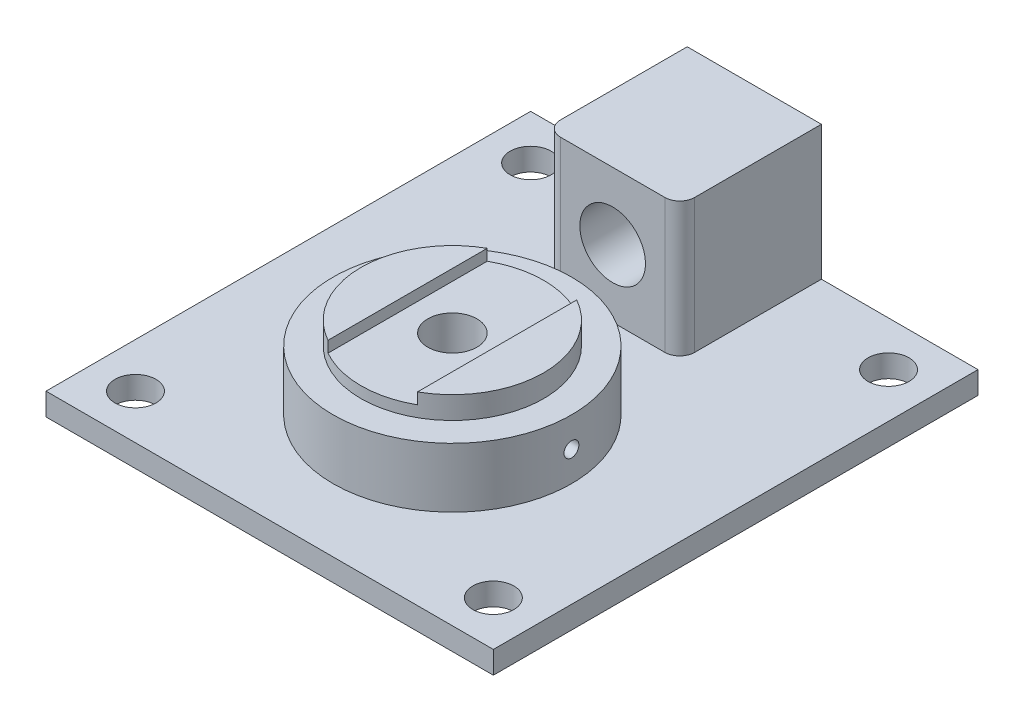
from build123d import *

# Parameters (mm, degrees)
SKIZZE1_W                                           = 60
SKIZZE1_H                                           = 65
LINEAR_AUSTRAGEN1_DEPTH                             = 3
SKIZZE3_R                                           = 16
LINEAR_AUSTRAGEN2_DEPTH                             = 8
SKIZZE8_R                                           = 12.25
LINEAR_AUSTRAGEN4_DEPTH                             = 3
LINEAR_START                                        = -1.5
LINEAR_AUSTRAGEN6_DEPTH                             = 1.5
STIRNSENKUNG_F_R_M6_SENKSCHRAUBE_KOPF_B_D           = 6.6
STIRNSENKUNG_F_R_M6_SENKSCHRAUBE_KOPF_B_CBORE_D     = 11.5
STIRNSENKUNG_F_R_M6_SENKSCHRAUBE_KOPF_B_CBORE_DEPTH = 3.3
SKIZZE18_W                                          = 18
SKIZZE18_H                                          = 19
LINEAR_AUSTRAGEN8_DEPTH                             = 18
M10X1_25_GEWINDEBOHRUNG2_D                          = 8.8
M10X1_25_GEWINDEBOHRUNG2_DEPTH                      = 19
SKIZZE21_R                                          = 2.75
LINEAR_AUSTRAGEN9_DEPTH                             = 55.444108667
VERRUNDUNG1_R                                       = 2
LINEAR_AUSTRAGEN10_DEPTH                            = 56.508206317
LINEAR_AUSTRAGEN10_DEPTH_BACK                       = 56.508206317
SKIZZE22_R                                          = 1


with BuildPart() as part:
    # Skizze1 → Linear austragen1 (new body)
    with BuildSketch(Plane(origin=(0, 0, 0), x_dir=(1, 0, 0), z_dir=(0, 1, 0))):
        with Locations((4.823033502, 5.2825)):
            Rectangle(SKIZZE1_W, SKIZZE1_H)
    extrude(amount=LINEAR_AUSTRAGEN1_DEPTH)

    # Skizze3 → Linear austragen2 (add)
    with BuildSketch(Plane(origin=(0, 3, 0), x_dir=(1, 0, 0), z_dir=(0, 1, 0))):
        with Locations(Location((4.823033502, -2.7175, 0), (0, 0, 270))):
            Circle(SKIZZE3_R)
    extrude(amount=LINEAR_AUSTRAGEN2_DEPTH)

    # Skizze8 → Linear austragen4 (add)
    with BuildSketch(Plane(origin=(0, 11, 0), x_dir=(1, 0, 0), z_dir=(0, 1, 0))):
        with Locations(Location((4.823033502, -2.7175, 0), (0, 0, 270))):
            Circle(SKIZZE8_R)
    extrude(amount=LINEAR_AUSTRAGEN4_DEPTH)

    # Skizze10 → Linear austragen6 (cut)
    with BuildSketch(Plane(origin=(0, 14, 0), x_dir=(1, 0, 0), z_dir=(0, 1, 0)).offset(LINEAR_START)):
        with BuildLine():
            Line((-1.176966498, 7.962504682), (-1.176966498, -13.397504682))
            ThreePointArc((-1.176966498, -13.397504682), (4.823033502, -14.9675), (10.823033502, -13.397504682))
            Line((10.823033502, -13.397504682), (10.823033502, 7.962504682))
            ThreePointArc((10.823033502, 7.962504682), (4.823033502, 9.5325), (-1.176966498, 7.962504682))
        make_face()
    extrude(amount=LINEAR_AUSTRAGEN6_DEPTH, mode=Mode.SUBTRACT)

    # Stirnsenkung f_r M6 Senkschraube _Kopf B (through all)
    with Locations(Plane(origin=(4.823033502, 0, 2.7175), x_dir=(0, 0, -1), z_dir=(0, -1, 0))):
        with Locations((0, 0)):
            CounterBoreHole(STIRNSENKUNG_F_R_M6_SENKSCHRAUBE_KOPF_B_D / 2, STIRNSENKUNG_F_R_M6_SENKSCHRAUBE_KOPF_B_CBORE_D / 2, STIRNSENKUNG_F_R_M6_SENKSCHRAUBE_KOPF_B_CBORE_DEPTH)

    # Skizze18 → Linear austragen8 (add)
    with BuildSketch(Plane(origin=(0, 3, 0), x_dir=(1, 0, 0), z_dir=(0, 1, 0))):
        with Locations((4.823033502, 28.2825)):
            Rectangle(SKIZZE18_W, SKIZZE18_H)
    extrude(amount=LINEAR_AUSTRAGEN8_DEPTH)

    # M10x1.25 Gewindebohrung2
    with Locations(Plane(origin=(4.823033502, 12, -37.7825), x_dir=(-1, 0, 0), z_dir=(0, 0, -1))):
        with Locations((0, 0)):
            Hole(M10X1_25_GEWINDEBOHRUNG2_D / 2, depth=M10X1_25_GEWINDEBOHRUNG2_DEPTH)

    # Skizze21 → Linear austragen9 (cut, through all)
    with BuildSketch(Plane(origin=(0, 3, 0), x_dir=(1, 0, 0), z_dir=(0, 1, 0))):
        with Locations(Location((28.823033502, -21.2175, 0), (0, 0, 270))):
            Circle(SKIZZE21_R)
        with Locations(Location((-19.176966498, -21.2175, 0), (0, 0, 270))):
            Circle(SKIZZE21_R)
        with Locations(Location((-19.176966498, 31.7825, 0), (0, 0, 270))):
            Circle(SKIZZE21_R)
        with Locations(Location((28.823033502, 31.7825, 0), (0, 0, 270))):
            Circle(SKIZZE21_R)
    extrude(amount=-LINEAR_AUSTRAGEN9_DEPTH, mode=Mode.SUBTRACT)

    # Verrundung1
    verrundung1_edges = [part.edges().sort_by_distance(p)[0] for p in [
        (13.823033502, 12, -18.7825),
        (-4.176966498, 12, -18.7825),
    ]]
    fillet(verrundung1_edges, radius=VERRUNDUNG1_R)

    # Skizze22 → Linear austragen10 (cut, two sides: drawn at the far end of the back side and taken through both)
    with BuildSketch(Plane(origin=(0, 0, 0), x_dir=(0, 0, -1), z_dir=(1, 0, 0)).offset(-LINEAR_AUSTRAGEN10_DEPTH_BACK)):
        with Locations((-2.7175, 7)):
            Circle(SKIZZE22_R)
    extrude(amount=LINEAR_AUSTRAGEN10_DEPTH + LINEAR_AUSTRAGEN10_DEPTH_BACK, mode=Mode.SUBTRACT)


solid = part.part
